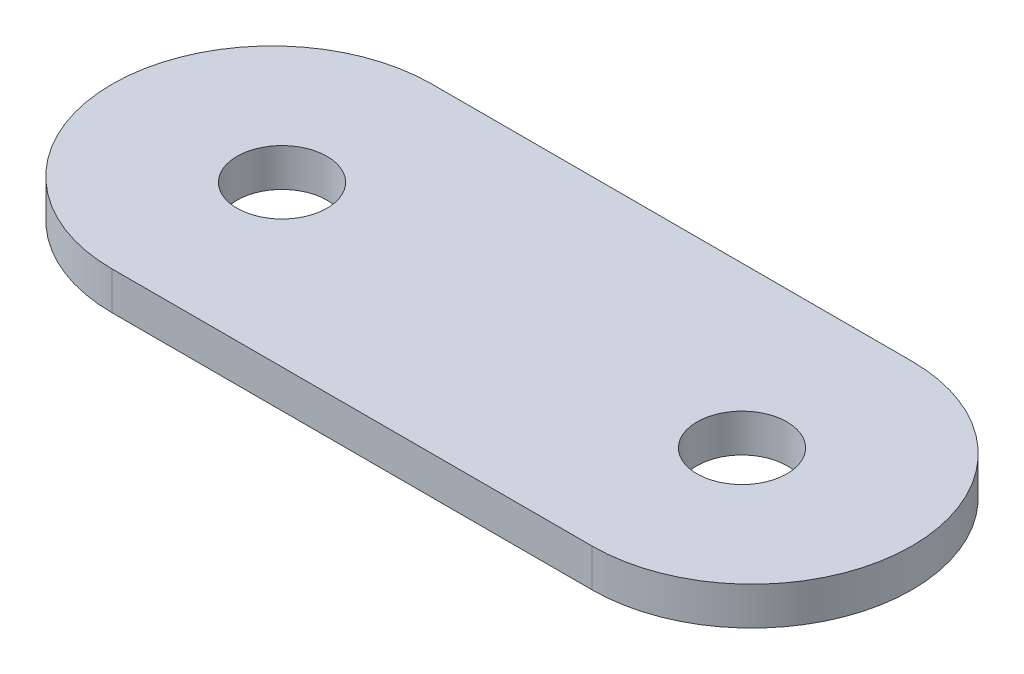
ISO-10303-21;
HEADER;
FILE_DESCRIPTION(('STEP AP214'),'2;1');
FILE_NAME('part.step','',(''),(''),'','','');
FILE_SCHEMA(('AUTOMOTIVE_DESIGN { 1 0 10303 214 1 1 1 1 }'));
ENDSEC;
DATA;
#1=APPLICATION_CONTEXT('core data for automotive mechanical design processes');
#2=APPLICATION_PROTOCOL_DEFINITION('international standard','automotive_design',2000,#1);
#3=PRODUCT_CONTEXT('',#1,'mechanical');
#4=PRODUCT('Part','Part','',(#3));
#5=PRODUCT_RELATED_PRODUCT_CATEGORY('part','',(#4));
#6=PRODUCT_DEFINITION_FORMATION('','',#4);
#7=PRODUCT_DEFINITION_CONTEXT('part definition',#1,'design');
#8=PRODUCT_DEFINITION('design','',#6,#7);
#9=PRODUCT_DEFINITION_SHAPE('','',#8);
#10=(LENGTH_UNIT() NAMED_UNIT(*) SI_UNIT(.MILLI.,.METRE.));
#11=(NAMED_UNIT(*) PLANE_ANGLE_UNIT() SI_UNIT($,.RADIAN.));
#12=(NAMED_UNIT(*) SI_UNIT($,.STERADIAN.) SOLID_ANGLE_UNIT());
#13=UNCERTAINTY_MEASURE_WITH_UNIT(LENGTH_MEASURE(1.E-05),#10,'distance_accuracy_value','');
#14=(GEOMETRIC_REPRESENTATION_CONTEXT(3) GLOBAL_UNCERTAINTY_ASSIGNED_CONTEXT((#13)) GLOBAL_UNIT_ASSIGNED_CONTEXT((#10,
#11,#12)) REPRESENTATION_CONTEXT('',''));
#15=CARTESIAN_POINT('',(0.,0.,0.));
#16=DIRECTION('',(0.,0.,1.));
#17=DIRECTION('',(1.,0.,0.));
#18=AXIS2_PLACEMENT_3D('',#15,#16,#17);
#19=CARTESIAN_POINT('',(-12.,1.9,0.));
#20=DIRECTION('',(0.,1.,0.));
#21=DIRECTION('',(0.,0.,1.));
#22=AXIS2_PLACEMENT_3D('',#19,#20,#21);
#23=PLANE('',#22);
#24=CARTESIAN_POINT('',(-11.5,1.9,0.));
#25=DIRECTION('',(0.,1.,0.));
#26=DIRECTION('',(0.,0.,1.));
#27=AXIS2_PLACEMENT_3D('',#24,#25,#26);
#28=CIRCLE('',#27,2.25);
#29=CARTESIAN_POINT('',(-11.5,1.9,-2.25));
#30=VERTEX_POINT('',#29);
#31=EDGE_CURVE('E103',#30,#30,#28,.T.);
#32=ORIENTED_EDGE('',*,*,#31,.F.);
#33=EDGE_LOOP('',(#32));
#34=FACE_BOUND('',#33,.T.);
#35=CARTESIAN_POINT('',(-12.,1.9,0.));
#36=DIRECTION('',(0.,1.,0.));
#37=DIRECTION('',(0.,0.,1.));
#38=AXIS2_PLACEMENT_3D('',#35,#36,#37);
#39=CIRCLE('',#38,8.);
#40=CARTESIAN_POINT('',(-12.,1.9,-8.));
#41=VERTEX_POINT('',#40);
#42=CARTESIAN_POINT('',(-12.,1.9,8.));
#43=VERTEX_POINT('',#42);
#44=EDGE_CURVE('E88',#41,#43,#39,.T.);
#45=ORIENTED_EDGE('',*,*,#44,.T.);
#46=DIRECTION('',(1.,0.,0.));
#47=VECTOR('',#46,1.);
#48=CARTESIAN_POINT('',(-12.,1.9,8.));
#49=LINE('',#48,#47);
#50=CARTESIAN_POINT('',(12.,1.9,8.));
#51=VERTEX_POINT('',#50);
#52=EDGE_CURVE('E83',#43,#51,#49,.T.);
#53=ORIENTED_EDGE('',*,*,#52,.T.);
#54=CARTESIAN_POINT('',(12.,1.9,0.));
#55=DIRECTION('',(0.,1.,0.));
#56=DIRECTION('',(0.,0.,1.));
#57=AXIS2_PLACEMENT_3D('',#54,#55,#56);
#58=CIRCLE('',#57,8.);
#59=CARTESIAN_POINT('',(12.,1.9,-8.));
#60=VERTEX_POINT('',#59);
#61=EDGE_CURVE('E86',#51,#60,#58,.T.);
#62=ORIENTED_EDGE('',*,*,#61,.T.);
#63=DIRECTION('',(-1.,0.,0.));
#64=VECTOR('',#63,1.);
#65=CARTESIAN_POINT('',(-12.,1.9,-8.));
#66=LINE('',#65,#64);
#67=EDGE_CURVE('E53',#60,#41,#66,.T.);
#68=ORIENTED_EDGE('',*,*,#67,.T.);
#69=EDGE_LOOP('',(#45,#53,#62,#68));
#70=FACE_BOUND('',#69,.T.);
#71=CARTESIAN_POINT('',(11.5,1.9,0.));
#72=DIRECTION('',(0.,1.,0.));
#73=DIRECTION('',(0.,0.,1.));
#74=AXIS2_PLACEMENT_3D('',#71,#72,#73);
#75=CIRCLE('',#74,2.25);
#76=CARTESIAN_POINT('',(11.5,1.9,-2.25));
#77=VERTEX_POINT('',#76);
#78=EDGE_CURVE('E118',#77,#77,#75,.T.);
#79=ORIENTED_EDGE('',*,*,#78,.F.);
#80=EDGE_LOOP('',(#79));
#81=FACE_BOUND('',#80,.T.);
#82=ADVANCED_FACE('F36',(#34,#70,#81),#23,.T.);
#83=CARTESIAN_POINT('',(-12.,0.,0.));
#84=DIRECTION('',(0.,1.,0.));
#85=DIRECTION('',(0.,0.,1.));
#86=AXIS2_PLACEMENT_3D('',#83,#84,#85);
#87=PLANE('',#86);
#88=CARTESIAN_POINT('',(-12.,0.,0.));
#89=DIRECTION('',(0.,1.,0.));
#90=DIRECTION('',(0.,0.,1.));
#91=AXIS2_PLACEMENT_3D('',#88,#89,#90);
#92=CIRCLE('',#91,8.);
#93=CARTESIAN_POINT('',(-12.,0.,-8.));
#94=VERTEX_POINT('',#93);
#95=CARTESIAN_POINT('',(-12.,0.,8.));
#96=VERTEX_POINT('',#95);
#97=EDGE_CURVE('E100',#94,#96,#92,.T.);
#98=ORIENTED_EDGE('',*,*,#97,.F.);
#99=DIRECTION('',(-1.,0.,0.));
#100=VECTOR('',#99,1.);
#101=CARTESIAN_POINT('',(-12.,0.,-8.));
#102=LINE('',#101,#100);
#103=CARTESIAN_POINT('',(12.,0.,-8.));
#104=VERTEX_POINT('',#103);
#105=EDGE_CURVE('E76',#104,#94,#102,.T.);
#106=ORIENTED_EDGE('',*,*,#105,.F.);
#107=CARTESIAN_POINT('',(12.,0.,0.));
#108=DIRECTION('',(0.,1.,0.));
#109=DIRECTION('',(0.,0.,1.));
#110=AXIS2_PLACEMENT_3D('',#107,#108,#109);
#111=CIRCLE('',#110,8.);
#112=CARTESIAN_POINT('',(12.,0.,8.));
#113=VERTEX_POINT('',#112);
#114=EDGE_CURVE('E70',#113,#104,#111,.T.);
#115=ORIENTED_EDGE('',*,*,#114,.F.);
#116=DIRECTION('',(1.,0.,0.));
#117=VECTOR('',#116,1.);
#118=CARTESIAN_POINT('',(-12.,0.,8.));
#119=LINE('',#118,#117);
#120=EDGE_CURVE('E92',#96,#113,#119,.T.);
#121=ORIENTED_EDGE('',*,*,#120,.F.);
#122=EDGE_LOOP('',(#98,#106,#115,#121));
#123=FACE_BOUND('',#122,.T.);
#124=CARTESIAN_POINT('',(-11.5,0.,0.));
#125=DIRECTION('',(0.,1.,0.));
#126=DIRECTION('',(0.,0.,1.));
#127=AXIS2_PLACEMENT_3D('',#124,#125,#126);
#128=CIRCLE('',#127,2.25);
#129=CARTESIAN_POINT('',(-11.5,0.,-2.25));
#130=VERTEX_POINT('',#129);
#131=EDGE_CURVE('E115',#130,#130,#128,.T.);
#132=ORIENTED_EDGE('',*,*,#131,.T.);
#133=EDGE_LOOP('',(#132));
#134=FACE_BOUND('',#133,.T.);
#135=CARTESIAN_POINT('',(11.5,0.,0.));
#136=DIRECTION('',(0.,1.,0.));
#137=DIRECTION('',(0.,0.,1.));
#138=AXIS2_PLACEMENT_3D('',#135,#136,#137);
#139=CIRCLE('',#138,2.25);
#140=CARTESIAN_POINT('',(11.5,0.,-2.25));
#141=VERTEX_POINT('',#140);
#142=EDGE_CURVE('E121',#141,#141,#139,.T.);
#143=ORIENTED_EDGE('',*,*,#142,.T.);
#144=EDGE_LOOP('',(#143));
#145=FACE_BOUND('',#144,.T.);
#146=ADVANCED_FACE('F111',(#123,#134,#145),#87,.F.);
#147=CARTESIAN_POINT('',(-12.,1.9,0.));
#148=DIRECTION('',(0.,-1.,0.));
#149=DIRECTION('',(0.,0.,-1.));
#150=AXIS2_PLACEMENT_3D('',#147,#148,#149);
#151=CYLINDRICAL_SURFACE('',#150,8.);
#152=ORIENTED_EDGE('',*,*,#97,.T.);
#153=DIRECTION('',(0.,-1.,0.));
#154=VECTOR('',#153,1.);
#155=CARTESIAN_POINT('',(-12.,1.9,8.));
#156=LINE('',#155,#154);
#157=EDGE_CURVE('E11',#43,#96,#156,.T.);
#158=ORIENTED_EDGE('',*,*,#157,.F.);
#159=ORIENTED_EDGE('',*,*,#44,.F.);
#160=DIRECTION('',(0.,-1.,0.));
#161=VECTOR('',#160,1.);
#162=CARTESIAN_POINT('',(-12.,1.9,-8.));
#163=LINE('',#162,#161);
#164=EDGE_CURVE('E96',#41,#94,#163,.T.);
#165=ORIENTED_EDGE('',*,*,#164,.T.);
#166=EDGE_LOOP('',(#152,#158,#159,#165));
#167=FACE_BOUND('',#166,.T.);
#168=ADVANCED_FACE('F38',(#167),#151,.T.);
#169=CARTESIAN_POINT('',(-12.,1.9,8.));
#170=DIRECTION('',(0.,0.,-1.));
#171=DIRECTION('',(-1.,0.,0.));
#172=AXIS2_PLACEMENT_3D('',#169,#170,#171);
#173=PLANE('',#172);
#174=ORIENTED_EDGE('',*,*,#120,.T.);
#175=DIRECTION('',(0.,-1.,0.));
#176=VECTOR('',#175,1.);
#177=CARTESIAN_POINT('',(12.,1.9,8.));
#178=LINE('',#177,#176);
#179=EDGE_CURVE('E45',#51,#113,#178,.T.);
#180=ORIENTED_EDGE('',*,*,#179,.F.);
#181=ORIENTED_EDGE('',*,*,#52,.F.);
#182=ORIENTED_EDGE('',*,*,#157,.T.);
#183=EDGE_LOOP('',(#174,#180,#181,#182));
#184=FACE_BOUND('',#183,.T.);
#185=ADVANCED_FACE('F91',(#184),#173,.F.);
#186=CARTESIAN_POINT('',(12.,1.9,0.));
#187=DIRECTION('',(0.,-1.,0.));
#188=DIRECTION('',(0.,0.,-1.));
#189=AXIS2_PLACEMENT_3D('',#186,#187,#188);
#190=CYLINDRICAL_SURFACE('',#189,8.);
#191=ORIENTED_EDGE('',*,*,#114,.T.);
#192=DIRECTION('',(0.,-1.,0.));
#193=VECTOR('',#192,1.);
#194=CARTESIAN_POINT('',(12.,1.9,-8.));
#195=LINE('',#194,#193);
#196=EDGE_CURVE('E93',#60,#104,#195,.T.);
#197=ORIENTED_EDGE('',*,*,#196,.F.);
#198=ORIENTED_EDGE('',*,*,#61,.F.);
#199=ORIENTED_EDGE('',*,*,#179,.T.);
#200=EDGE_LOOP('',(#191,#197,#198,#199));
#201=FACE_BOUND('',#200,.T.);
#202=ADVANCED_FACE('F94',(#201),#190,.T.);
#203=CARTESIAN_POINT('',(-12.,1.9,-8.));
#204=DIRECTION('',(0.,0.,1.));
#205=DIRECTION('',(1.,0.,0.));
#206=AXIS2_PLACEMENT_3D('',#203,#204,#205);
#207=PLANE('',#206);
#208=ORIENTED_EDGE('',*,*,#105,.T.);
#209=ORIENTED_EDGE('',*,*,#164,.F.);
#210=ORIENTED_EDGE('',*,*,#67,.F.);
#211=ORIENTED_EDGE('',*,*,#196,.T.);
#212=EDGE_LOOP('',(#208,#209,#210,#211));
#213=FACE_BOUND('',#212,.T.);
#214=ADVANCED_FACE('F108',(#213),#207,.F.);
#215=CARTESIAN_POINT('',(-11.5,1.9,0.));
#216=DIRECTION('',(0.,-1.,0.));
#217=DIRECTION('',(0.,0.,-1.));
#218=AXIS2_PLACEMENT_3D('',#215,#216,#217);
#219=CYLINDRICAL_SURFACE('',#218,2.25);
#220=CARTESIAN_POINT('',(-11.5,1.9,-2.25));
#221=CARTESIAN_POINT('',(-11.5,1.88020833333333,-2.25));
#222=CARTESIAN_POINT('',(-11.5,1.86041666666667,-2.25));
#223=CARTESIAN_POINT('',(-11.5,1.82083333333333,-2.25));
#224=CARTESIAN_POINT('',(-11.5,1.80104166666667,-2.25));
#225=CARTESIAN_POINT('',(-11.5,1.76145833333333,-2.25));
#226=CARTESIAN_POINT('',(-11.5,1.74166666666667,-2.25));
#227=CARTESIAN_POINT('',(-11.5,1.70208333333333,-2.25));
#228=CARTESIAN_POINT('',(-11.5,1.68229166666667,-2.25));
#229=CARTESIAN_POINT('',(-11.5,1.64270833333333,-2.25));
#230=CARTESIAN_POINT('',(-11.5,1.62291666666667,-2.25));
#231=CARTESIAN_POINT('',(-11.5,1.58333333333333,-2.25));
#232=CARTESIAN_POINT('',(-11.5,1.56354166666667,-2.25));
#233=CARTESIAN_POINT('',(-11.5,1.52395833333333,-2.25));
#234=CARTESIAN_POINT('',(-11.5,1.50416666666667,-2.25));
#235=CARTESIAN_POINT('',(-11.5,1.46458333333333,-2.25));
#236=CARTESIAN_POINT('',(-11.5,1.44479166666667,-2.25));
#237=CARTESIAN_POINT('',(-11.5,1.40520833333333,-2.25));
#238=CARTESIAN_POINT('',(-11.5,1.38541666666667,-2.25));
#239=CARTESIAN_POINT('',(-11.5,1.34583333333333,-2.25));
#240=CARTESIAN_POINT('',(-11.5,1.32604166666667,-2.25));
#241=CARTESIAN_POINT('',(-11.5,1.28645833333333,-2.25));
#242=CARTESIAN_POINT('',(-11.5,1.26666666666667,-2.25));
#243=CARTESIAN_POINT('',(-11.5,1.22708333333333,-2.25));
#244=CARTESIAN_POINT('',(-11.5,1.20729166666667,-2.25));
#245=CARTESIAN_POINT('',(-11.5,1.16770833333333,-2.25));
#246=CARTESIAN_POINT('',(-11.5,1.14791666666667,-2.25));
#247=CARTESIAN_POINT('',(-11.5,1.10833333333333,-2.25));
#248=CARTESIAN_POINT('',(-11.5,1.08854166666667,-2.25));
#249=CARTESIAN_POINT('',(-11.5,1.04895833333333,-2.25));
#250=CARTESIAN_POINT('',(-11.5,1.02916666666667,-2.25));
#251=CARTESIAN_POINT('',(-11.5,0.989583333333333,-2.25));
#252=CARTESIAN_POINT('',(-11.5,0.969791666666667,-2.25));
#253=CARTESIAN_POINT('',(-11.5,0.930208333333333,-2.25));
#254=CARTESIAN_POINT('',(-11.5,0.910416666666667,-2.25));
#255=CARTESIAN_POINT('',(-11.5,0.870833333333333,-2.25));
#256=CARTESIAN_POINT('',(-11.5,0.851041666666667,-2.25));
#257=CARTESIAN_POINT('',(-11.5,0.811458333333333,-2.25));
#258=CARTESIAN_POINT('',(-11.5,0.791666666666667,-2.25));
#259=CARTESIAN_POINT('',(-11.5,0.752083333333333,-2.25));
#260=CARTESIAN_POINT('',(-11.5,0.732291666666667,-2.25));
#261=CARTESIAN_POINT('',(-11.5,0.692708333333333,-2.25));
#262=CARTESIAN_POINT('',(-11.5,0.672916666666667,-2.25));
#263=CARTESIAN_POINT('',(-11.5,0.633333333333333,-2.25));
#264=CARTESIAN_POINT('',(-11.5,0.613541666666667,-2.25));
#265=CARTESIAN_POINT('',(-11.5,0.573958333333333,-2.25));
#266=CARTESIAN_POINT('',(-11.5,0.554166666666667,-2.25));
#267=CARTESIAN_POINT('',(-11.5,0.514583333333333,-2.25));
#268=CARTESIAN_POINT('',(-11.5,0.494791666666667,-2.25));
#269=CARTESIAN_POINT('',(-11.5,0.455208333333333,-2.25));
#270=CARTESIAN_POINT('',(-11.5,0.435416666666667,-2.25));
#271=CARTESIAN_POINT('',(-11.5,0.395833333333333,-2.25));
#272=CARTESIAN_POINT('',(-11.5,0.376041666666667,-2.25));
#273=CARTESIAN_POINT('',(-11.5,0.336458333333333,-2.25));
#274=CARTESIAN_POINT('',(-11.5,0.316666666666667,-2.25));
#275=CARTESIAN_POINT('',(-11.5,0.277083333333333,-2.25));
#276=CARTESIAN_POINT('',(-11.5,0.257291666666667,-2.25));
#277=CARTESIAN_POINT('',(-11.5,0.217708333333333,-2.25));
#278=CARTESIAN_POINT('',(-11.5,0.197916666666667,-2.25));
#279=CARTESIAN_POINT('',(-11.5,0.158333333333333,-2.25));
#280=CARTESIAN_POINT('',(-11.5,0.138541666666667,-2.25));
#281=CARTESIAN_POINT('',(-11.5,0.0989583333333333,-2.25));
#282=CARTESIAN_POINT('',(-11.5,0.0791666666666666,-2.25));
#283=CARTESIAN_POINT('',(-11.5,0.0395833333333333,-2.25));
#284=CARTESIAN_POINT('',(-11.5,0.0197916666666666,-2.25));
#285=CARTESIAN_POINT('',(-11.5,0.,-2.25));
#286=B_SPLINE_CURVE_WITH_KNOTS('',3,(#220,#221,#222,#223,#224,#225,#226,#227,#228,#229,#230,
#231,#232,#233,#234,#235,#236,#237,#238,#239,#240,#241,#242,#243,#244,#245,#246,#247,#248,#249,
#250,#251,#252,#253,#254,#255,#256,#257,#258,#259,#260,#261,#262,#263,#264,#265,#266,#267,#268,
#269,#270,#271,#272,#273,#274,#275,#276,#277,#278,#279,#280,#281,#282,#283,#284,#285),
.UNSPECIFIED.,.F.,.F.,(4,2,2,2,2,2,2,2,2,2,2,2,2,2,2,2,2,2,2,2,2,2,2,2,2,2,2,2,2,2,2,2,4),(0.,
0.059375,0.11875,0.178125,0.2375,0.296875,0.35625,0.415625,0.475,0.534375,0.59375,0.653125,
0.7125,0.771875,0.83125,0.890625,0.95,1.009375,1.06875,1.128125,1.1875,1.246875,1.30625,
1.365625,1.425,1.484375,1.54375,1.603125,1.6625,1.721875,1.78125,1.840625,1.9),.UNSPECIFIED.);
#287=EDGE_CURVE('BSEAM138',#30,#130,#286,.T.);
#288=ORIENTED_EDGE('',*,*,#31,.T.);
#289=ORIENTED_EDGE('',*,*,#131,.F.);
#290=ORIENTED_EDGE('',*,*,#287,.T.);
#291=ORIENTED_EDGE('',*,*,#287,.F.);
#292=EDGE_LOOP('',(#288,#290,#289,#291));
#293=FACE_BOUND('',#292,.T.);
#294=ADVANCED_FACE('F138',(#293),#219,.F.);
#295=CARTESIAN_POINT('',(11.5,1.9,0.));
#296=DIRECTION('',(0.,-1.,0.));
#297=DIRECTION('',(0.,0.,-1.));
#298=AXIS2_PLACEMENT_3D('',#295,#296,#297);
#299=CYLINDRICAL_SURFACE('',#298,2.25);
#300=CARTESIAN_POINT('',(11.5,1.9,-2.25));
#301=CARTESIAN_POINT('',(11.5,1.88020833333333,-2.25));
#302=CARTESIAN_POINT('',(11.5,1.86041666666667,-2.25));
#303=CARTESIAN_POINT('',(11.5,1.82083333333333,-2.25));
#304=CARTESIAN_POINT('',(11.5,1.80104166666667,-2.25));
#305=CARTESIAN_POINT('',(11.5,1.76145833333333,-2.25));
#306=CARTESIAN_POINT('',(11.5,1.74166666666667,-2.25));
#307=CARTESIAN_POINT('',(11.5,1.70208333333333,-2.25));
#308=CARTESIAN_POINT('',(11.5,1.68229166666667,-2.25));
#309=CARTESIAN_POINT('',(11.5,1.64270833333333,-2.25));
#310=CARTESIAN_POINT('',(11.5,1.62291666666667,-2.25));
#311=CARTESIAN_POINT('',(11.5,1.58333333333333,-2.25));
#312=CARTESIAN_POINT('',(11.5,1.56354166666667,-2.25));
#313=CARTESIAN_POINT('',(11.5,1.52395833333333,-2.25));
#314=CARTESIAN_POINT('',(11.5,1.50416666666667,-2.25));
#315=CARTESIAN_POINT('',(11.5,1.46458333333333,-2.25));
#316=CARTESIAN_POINT('',(11.5,1.44479166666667,-2.25));
#317=CARTESIAN_POINT('',(11.5,1.40520833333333,-2.25));
#318=CARTESIAN_POINT('',(11.5,1.38541666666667,-2.25));
#319=CARTESIAN_POINT('',(11.5,1.34583333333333,-2.25));
#320=CARTESIAN_POINT('',(11.5,1.32604166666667,-2.25));
#321=CARTESIAN_POINT('',(11.5,1.28645833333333,-2.25));
#322=CARTESIAN_POINT('',(11.5,1.26666666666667,-2.25));
#323=CARTESIAN_POINT('',(11.5,1.22708333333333,-2.25));
#324=CARTESIAN_POINT('',(11.5,1.20729166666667,-2.25));
#325=CARTESIAN_POINT('',(11.5,1.16770833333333,-2.25));
#326=CARTESIAN_POINT('',(11.5,1.14791666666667,-2.25));
#327=CARTESIAN_POINT('',(11.5,1.10833333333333,-2.25));
#328=CARTESIAN_POINT('',(11.5,1.08854166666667,-2.25));
#329=CARTESIAN_POINT('',(11.5,1.04895833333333,-2.25));
#330=CARTESIAN_POINT('',(11.5,1.02916666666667,-2.25));
#331=CARTESIAN_POINT('',(11.5,0.989583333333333,-2.25));
#332=CARTESIAN_POINT('',(11.5,0.969791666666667,-2.25));
#333=CARTESIAN_POINT('',(11.5,0.930208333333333,-2.25));
#334=CARTESIAN_POINT('',(11.5,0.910416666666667,-2.25));
#335=CARTESIAN_POINT('',(11.5,0.870833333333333,-2.25));
#336=CARTESIAN_POINT('',(11.5,0.851041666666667,-2.25));
#337=CARTESIAN_POINT('',(11.5,0.811458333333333,-2.25));
#338=CARTESIAN_POINT('',(11.5,0.791666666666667,-2.25));
#339=CARTESIAN_POINT('',(11.5,0.752083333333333,-2.25));
#340=CARTESIAN_POINT('',(11.5,0.732291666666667,-2.25));
#341=CARTESIAN_POINT('',(11.5,0.692708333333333,-2.25));
#342=CARTESIAN_POINT('',(11.5,0.672916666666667,-2.25));
#343=CARTESIAN_POINT('',(11.5,0.633333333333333,-2.25));
#344=CARTESIAN_POINT('',(11.5,0.613541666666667,-2.25));
#345=CARTESIAN_POINT('',(11.5,0.573958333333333,-2.25));
#346=CARTESIAN_POINT('',(11.5,0.554166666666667,-2.25));
#347=CARTESIAN_POINT('',(11.5,0.514583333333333,-2.25));
#348=CARTESIAN_POINT('',(11.5,0.494791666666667,-2.25));
#349=CARTESIAN_POINT('',(11.5,0.455208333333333,-2.25));
#350=CARTESIAN_POINT('',(11.5,0.435416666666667,-2.25));
#351=CARTESIAN_POINT('',(11.5,0.395833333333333,-2.25));
#352=CARTESIAN_POINT('',(11.5,0.376041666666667,-2.25));
#353=CARTESIAN_POINT('',(11.5,0.336458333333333,-2.25));
#354=CARTESIAN_POINT('',(11.5,0.316666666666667,-2.25));
#355=CARTESIAN_POINT('',(11.5,0.277083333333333,-2.25));
#356=CARTESIAN_POINT('',(11.5,0.257291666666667,-2.25));
#357=CARTESIAN_POINT('',(11.5,0.217708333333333,-2.25));
#358=CARTESIAN_POINT('',(11.5,0.197916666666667,-2.25));
#359=CARTESIAN_POINT('',(11.5,0.158333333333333,-2.25));
#360=CARTESIAN_POINT('',(11.5,0.138541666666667,-2.25));
#361=CARTESIAN_POINT('',(11.5,0.0989583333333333,-2.25));
#362=CARTESIAN_POINT('',(11.5,0.0791666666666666,-2.25));
#363=CARTESIAN_POINT('',(11.5,0.0395833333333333,-2.25));
#364=CARTESIAN_POINT('',(11.5,0.0197916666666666,-2.25));
#365=CARTESIAN_POINT('',(11.5,0.,-2.25));
#366=B_SPLINE_CURVE_WITH_KNOTS('',3,(#300,#301,#302,#303,#304,#305,#306,#307,#308,#309,#310,
#311,#312,#313,#314,#315,#316,#317,#318,#319,#320,#321,#322,#323,#324,#325,#326,#327,#328,#329,
#330,#331,#332,#333,#334,#335,#336,#337,#338,#339,#340,#341,#342,#343,#344,#345,#346,#347,#348,
#349,#350,#351,#352,#353,#354,#355,#356,#357,#358,#359,#360,#361,#362,#363,#364,#365),
.UNSPECIFIED.,.F.,.F.,(4,2,2,2,2,2,2,2,2,2,2,2,2,2,2,2,2,2,2,2,2,2,2,2,2,2,2,2,2,2,2,2,4),(0.,
0.059375,0.11875,0.178125,0.2375,0.296875,0.35625,0.415625,0.475,0.534375,0.59375,0.653125,
0.7125,0.771875,0.83125,0.890625,0.95,1.009375,1.06875,1.128125,1.1875,1.246875,1.30625,
1.365625,1.425,1.484375,1.54375,1.603125,1.6625,1.721875,1.78125,1.840625,1.9),.UNSPECIFIED.);
#367=EDGE_CURVE('BSEAM127',#77,#141,#366,.T.);
#368=ORIENTED_EDGE('',*,*,#78,.T.);
#369=ORIENTED_EDGE('',*,*,#142,.F.);
#370=ORIENTED_EDGE('',*,*,#367,.T.);
#371=ORIENTED_EDGE('',*,*,#367,.F.);
#372=EDGE_LOOP('',(#368,#370,#369,#371));
#373=FACE_BOUND('',#372,.T.);
#374=ADVANCED_FACE('F127',(#373),#299,.F.);
#375=CLOSED_SHELL('',(#82,#146,#168,#185,#202,#214,#294,#374));
#376=MANIFOLD_SOLID_BREP('B2',#375);
#377=ADVANCED_BREP_SHAPE_REPRESENTATION('',(#18,#376),#14);
#378=SHAPE_DEFINITION_REPRESENTATION(#9,#377);
ENDSEC;
END-ISO-10303-21;
